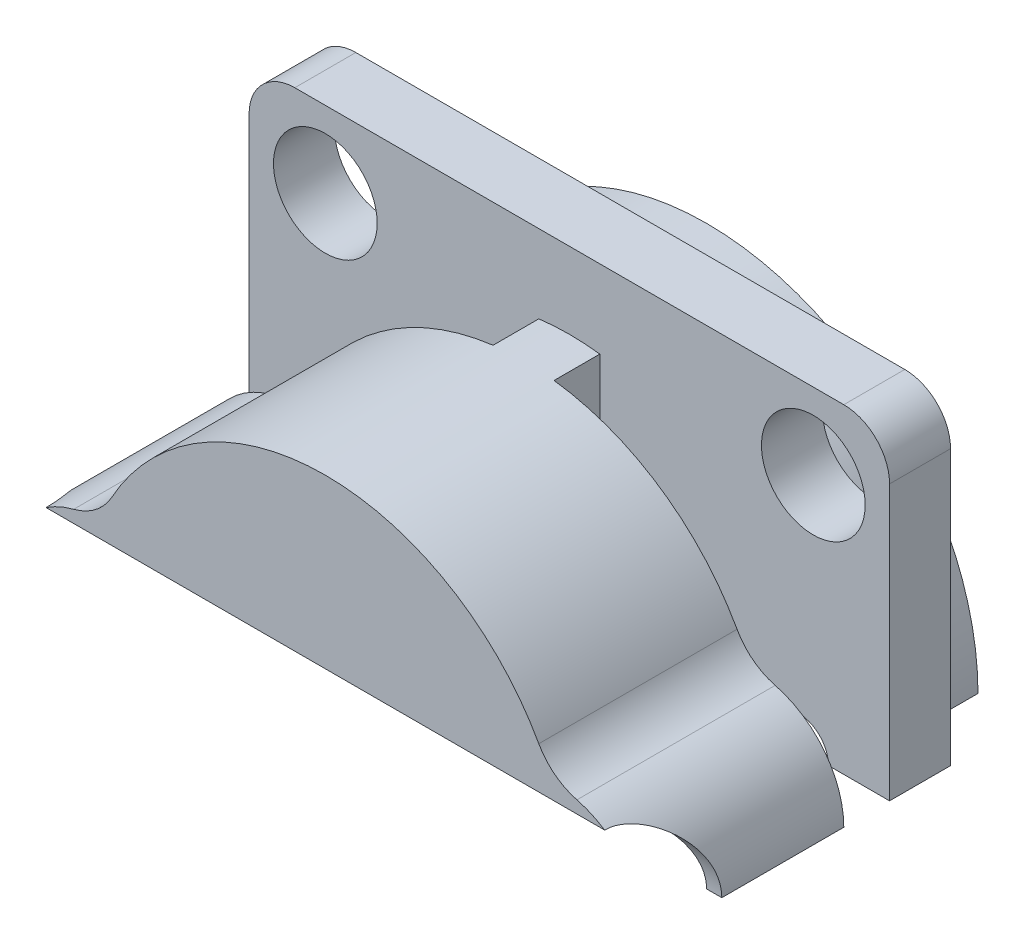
from build123d import *

# Parameters (mm, degrees)
ESQUISSE1_W                                        = 21
ESQUISSE1_H                                        = 21
EXTRUSION1_DEPTH                                   = 2
ESQUISSE2_R                                        = 8
EXTRUSION2_DEPTH                                   = 8
D_GAGEMENT_M31_D                                   = 3.4
R_P_TITION_LIN_AIRE1_COUNT                         = 2
R_P_TITION_LIN_AIRE1_PITCH                         = 16
R_P_TITION_LIN_AIRE1_COUNT_DIR2                    = 2
R_P_TITION_LIN_AIRE1_PITCH_DIR2                    = 16
CONG_1_R                                           = 1.5
ESQUISSE7_R                                        = 8.9
EXTRUSION4_DEPTH                                   = 2.5
ESQUISSE8_R                                        = 4.530803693
ENL_V_MAT_EXTRU_2_DEPTH                            = 2.5
ENL_V_MAT_EXTRU_6_REACH                            = 33.337
ESQUISSE9_R                                        = 2.5
ESQUISSE10_R                                       = 3
EXTRUSION5_DEPTH                                   = 8
CONG_2_R                                           = 2
ESQUISSE11_W                                       = 9.5
ESQUISSE11_H                                       = 1.5
ENL_V_MAT_EXTRU_7_DEPTH                            = 32.336879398
CHAMBRAGE_POUR_VIS_T_TE_RONDE_BOMB_E_M_D           = 2.2
CHAMBRAGE_POUR_VIS_T_TE_RONDE_BOMB_E_M_DEPTH       = 6.5
CHAMBRAGE_POUR_VIS_T_TE_RONDE_BOMB_E_M_CBORE_D     = 5
CHAMBRAGE_POUR_VIS_T_TE_RONDE_BOMB_E_M_CBORE_DEPTH = 5
ESQUISSE20_R                                       = 2.5
ENL_V_MAT_EXTRU_9_DEPTH                            = 32.336879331
CHAMBRAGE_POUR_VIS_T_TE_RONDE_BOMB_2_D             = 2.2
CHAMBRAGE_POUR_VIS_T_TE_RONDE_BOMB_2_DEPTH         = 6.5
CHAMBRAGE_POUR_VIS_T_TE_RONDE_BOMB_2_CBORE_D       = 5
CHAMBRAGE_POUR_VIS_T_TE_RONDE_BOMB_2_CBORE_DEPTH   = 5
TROU_TARAUD_M2X0_42_D                              = 2
TROU_TARAUD_M2X0_43_D                              = 2
ESQUISSE34_W                                       = 21.011293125
ESQUISSE34_H                                       = 10.5
ENL_V_MAT_EXTRU_11_DEPTH                           = 10


with BuildPart() as part:
    # Esquisse1 → Extrusion1 (new body)
    with BuildSketch(Plane.XY):
        with Locations((-10.5, 10.5)):
            Rectangle(ESQUISSE1_W, ESQUISSE1_H)
    extrude(amount=EXTRUSION1_DEPTH)

    # Esquisse2 → Extrusion2 (add)
    with BuildSketch(Plane.XY.offset(2)):
        with Locations((-10.5, 10.5)):
            Circle(ESQUISSE2_R)
    extrude(amount=EXTRUSION2_DEPTH)

    # D_gagement M31 (through all)
    with Locations(Plane.XY.offset(2)):
        with Locations((-2.5, 18.5)):
            d_gagement_m31 = Hole(D_GAGEMENT_M31_D / 2)

    # R_p_tition lin_aire1: D_gagement M31 2 × 2
    with Locations(*[(-j * R_P_TITION_LIN_AIRE1_PITCH_DIR2, -i * R_P_TITION_LIN_AIRE1_PITCH, 0) for i in range(R_P_TITION_LIN_AIRE1_COUNT) for j in range(R_P_TITION_LIN_AIRE1_COUNT_DIR2) if (i, j) != (0, 0)]):
        add(d_gagement_m31, mode=Mode.SUBTRACT)

    # Cong_1
    cong_1_edges = [part.edges().sort_by_distance(p)[0] for p in [
        (-21, 21, 1),
        (0, 21, 1),
        (0, 0, 1),
        (-21, 0, 1),
    ]]
    fillet(cong_1_edges, radius=CONG_1_R)

    # Esquisse7 → Extrusion4 (add)
    with BuildSketch(Plane(origin=(0, 0, 0), x_dir=(-1, 0, 0), z_dir=(0, 0, -1))):
        with Locations(Location((10.5, 10.5, 0), (0, 0, 180))):
            Circle(ESQUISSE7_R)
    extrude(amount=EXTRUSION4_DEPTH)

    # Esquisse8 → Enl_v. mat.-Extru.2 (cut)
    with BuildSketch(Plane(origin=(0, 0, -2.5), x_dir=(-1, 0, 0), z_dir=(0, 0, -1))):
        with Locations((10.5, 10.5)):
            Circle(ESQUISSE8_R)
    extrude(amount=-ENL_V_MAT_EXTRU_2_DEPTH, mode=Mode.SUBTRACT)

    # Esquisse9 → Enl_v. mat.-Extru.6 (cut, up to next)
    with BuildSketch(Plane(origin=(0, 0, 0), x_dir=(-1, 0, 0), z_dir=(0, 0, -1)), mode=Mode.PRIVATE) as enl_v_mat_extru_6_sk1:
        with Locations((10.5, 10.5)):
            Circle(ESQUISSE9_R)
    enl_v_mat_extru_6_tool1 = extrude(enl_v_mat_extru_6_sk1.sketch, amount=-ENL_V_MAT_EXTRU_6_REACH, mode=Mode.PRIVATE) & part.part
    add(enl_v_mat_extru_6_tool1.solids().sort_by_distance((-10.5, 10.5, 0))[0], mode=Mode.SUBTRACT)

    # Esquisse10 → Extrusion5 (add)
    with BuildSketch(Plane.XY.offset(2)):
        with Locations((-18, 10.5)):
            Circle(ESQUISSE10_R)
        with Locations((-3, 10.5)):
            Circle(ESQUISSE10_R)
    extrude(amount=EXTRUSION5_DEPTH)

    # Cong_2
    cong_2_edges = [part.edges().sort_by_distance(p)[0] for p in [
        (-17.916666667, 13.498842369, 6),
        (-17.916666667, 7.501157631, 6),
        (-3.083333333, 7.501157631, 6),
        (-3.083333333, 13.498842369, 6),
    ]]
    fillet(cong_2_edges, radius=CONG_2_R)

    # Esquisse11 → Enl_v. mat.-Extru.7 (cut, through all)
    with BuildSketch(Plane(origin=(0, 21, 0), x_dir=(-1, 0, 0), z_dir=(0, 1, 0))):
        with Locations((4.75, 2.75)):
            Rectangle(ESQUISSE11_W, ESQUISSE11_H)
        with Locations((16.25, 2.75)):
            Rectangle(ESQUISSE11_W, ESQUISSE11_H)
    extrude(amount=-ENL_V_MAT_EXTRU_7_DEPTH, mode=Mode.SUBTRACT)

    # Chambrage pour vis _ t_te ronde bomb_e M
    with Locations(Plane.XY.offset(10)):
        with Locations((-18, 10.5)):
            CounterBoreHole(CHAMBRAGE_POUR_VIS_T_TE_RONDE_BOMB_E_M_D / 2, CHAMBRAGE_POUR_VIS_T_TE_RONDE_BOMB_E_M_CBORE_D / 2, CHAMBRAGE_POUR_VIS_T_TE_RONDE_BOMB_E_M_CBORE_DEPTH, depth=CHAMBRAGE_POUR_VIS_T_TE_RONDE_BOMB_E_M_DEPTH)

    # Esquisse20 → Enl_v. mat.-Extru.9 (cut, through all)
    with BuildSketch(Plane.ZY.offset(21)):
        with Locations((10, 10.5)):
            Circle(ESQUISSE20_R)
    extrude(amount=-ENL_V_MAT_EXTRU_9_DEPTH, mode=Mode.SUBTRACT)

    # Chambrage pour vis _ t_te ronde bomb 2
    with Locations(Plane.XY.offset(10)):
        with Locations((-3, 10.5)):
            CounterBoreHole(CHAMBRAGE_POUR_VIS_T_TE_RONDE_BOMB_2_D / 2, CHAMBRAGE_POUR_VIS_T_TE_RONDE_BOMB_2_CBORE_D / 2, CHAMBRAGE_POUR_VIS_T_TE_RONDE_BOMB_2_CBORE_DEPTH, depth=CHAMBRAGE_POUR_VIS_T_TE_RONDE_BOMB_2_DEPTH)

    # Trou taraud_ M2x0.42 (through all)
    with Locations(Plane.XY.offset(2)):
        with Locations((-18, 10.5)):
            Hole(TROU_TARAUD_M2X0_42_D / 2)

    # Trou taraud_ M2x0.43 (through all)
    with Locations(Plane.XY.offset(2)):
        with Locations((-3, 10.5)):
            Hole(TROU_TARAUD_M2X0_43_D / 2)

    # Esquisse34 → Enl_v. mat.-Extru.11 (cut, symmetric)
    with BuildSketch(Plane(origin=(0, 0, 0), x_dir=(-1, 0, 0), z_dir=(0, 0, -1))):
        with Locations((10.505646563, 5.25)):
            Rectangle(ESQUISSE34_W, ESQUISSE34_H)
    extrude(amount=ENL_V_MAT_EXTRU_11_DEPTH, both=True, mode=Mode.SUBTRACT)


solid = part.part
